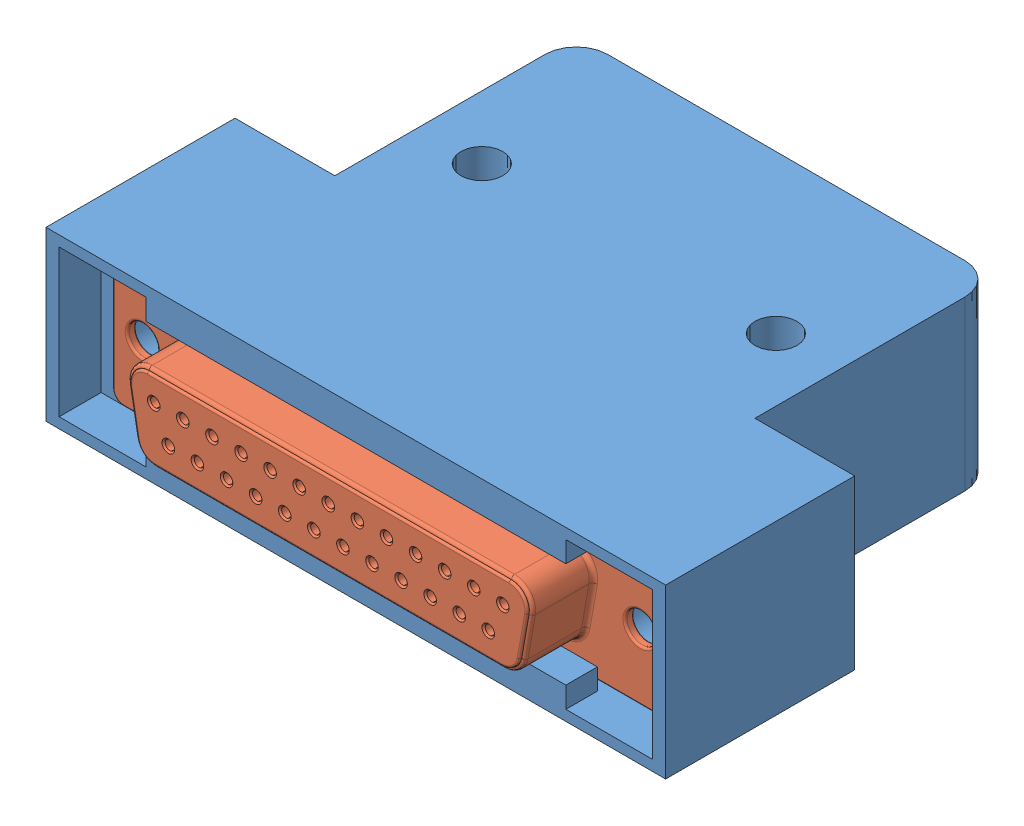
SolidWorks assembly SETDSUB-B-ML-PS-25.SLDASM, configuration Default (file format 9000). Lengths in mm.
Overall size (59 16 43.8).
2 component instances, 2 part files, 3 mates.
Components (placement in the parent):
- SETDSUB-B-ML-PP-25-1: SETDSUB-B-ML-PP-25.SLDPRT [Default] at (26.9288 36.0224 41.6436) size (59 16 41)
- D SUB 25P female - FL25S7-K121 (FCT)-1: D SUB 25P female - FL25S7-K121 (FCT).SLDPRT [Default] at (27.1088 36.0224 55.6436) x (1 0 0) z (0 -1 0) size (56.2 6.8 15.4)
Mates (geometry in assembly coordinates):
- Coincident1: coincident: plane of SETDSUB-B-ML-PP-25-1 through (26.9288 36.0224 55.6436) normal (0 0 1); plane of D SUB 25P female - FL25S7-K121 (FCT)-1 through (1.6088 30.7724 55.6436) normal (0 0 -1)
- Concentric1: concentric: cylinder of SETDSUB-B-ML-PP-25-1 through (3.4088 36.0224 18.6436) axis (0 0 1) radius 2.5; cylinder of D SUB 25P female - FL25S7-K121 (FCT)-1 through (3.4088 36.0224 55.6436) axis (0 0 1) radius 1.45
- Parallel1: parallel aligned: line of SETDSUB-B-ML-PP-25-1 through (-1.3212 43.0224 55.6436) axis (0 -1 0); line of D SUB 25P female - FL25S7-K121 (FCT)-1 through (0.7088 41.2724 56.4436) axis (0 -1 0)
